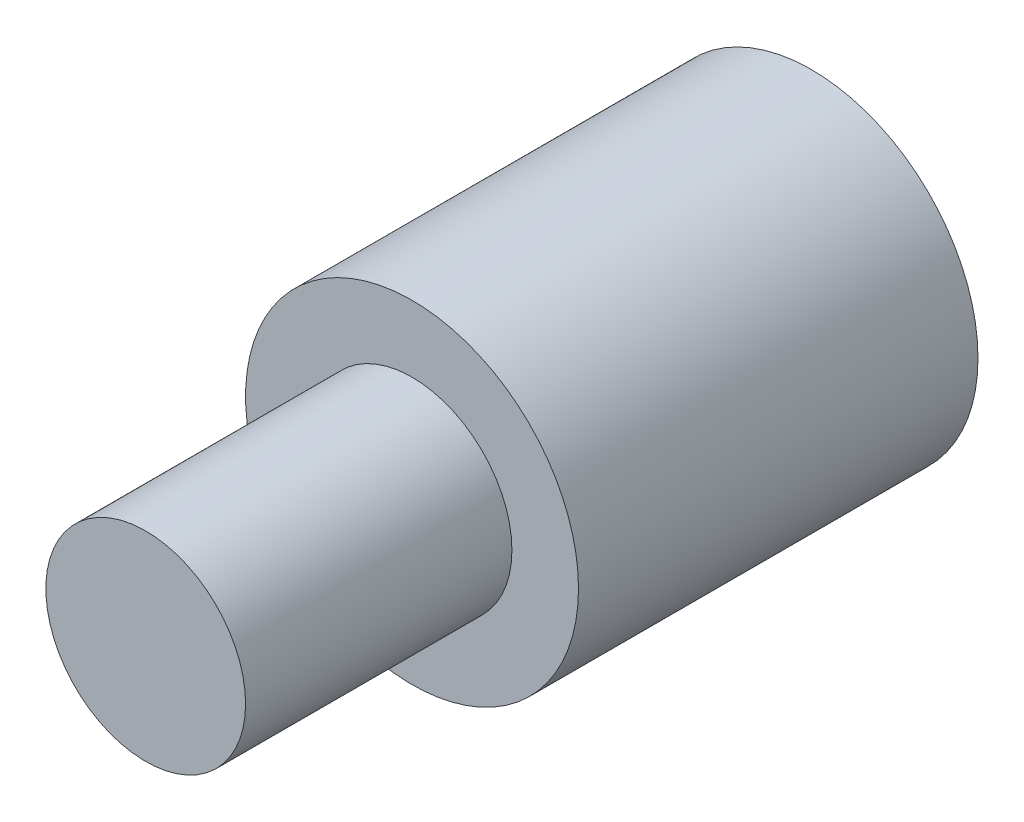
ISO-10303-21;
HEADER;
FILE_DESCRIPTION(('STEP AP214'),'2;1');
FILE_NAME('part.step','',(''),(''),'','','');
FILE_SCHEMA(('AUTOMOTIVE_DESIGN { 1 0 10303 214 1 1 1 1 }'));
ENDSEC;
DATA;
#1=APPLICATION_CONTEXT('core data for automotive mechanical design processes');
#2=APPLICATION_PROTOCOL_DEFINITION('international standard','automotive_design',2000,#1);
#3=PRODUCT_CONTEXT('',#1,'mechanical');
#4=PRODUCT('Part','Part','',(#3));
#5=PRODUCT_RELATED_PRODUCT_CATEGORY('part','',(#4));
#6=PRODUCT_DEFINITION_FORMATION('','',#4);
#7=PRODUCT_DEFINITION_CONTEXT('part definition',#1,'design');
#8=PRODUCT_DEFINITION('design','',#6,#7);
#9=PRODUCT_DEFINITION_SHAPE('','',#8);
#10=(LENGTH_UNIT() NAMED_UNIT(*) SI_UNIT(.MILLI.,.METRE.));
#11=(NAMED_UNIT(*) PLANE_ANGLE_UNIT() SI_UNIT($,.RADIAN.));
#12=(NAMED_UNIT(*) SI_UNIT($,.STERADIAN.) SOLID_ANGLE_UNIT());
#13=UNCERTAINTY_MEASURE_WITH_UNIT(LENGTH_MEASURE(1.E-05),#10,'distance_accuracy_value','');
#14=(GEOMETRIC_REPRESENTATION_CONTEXT(3) GLOBAL_UNCERTAINTY_ASSIGNED_CONTEXT((#13)) GLOBAL_UNIT_ASSIGNED_CONTEXT((#10,
#11,#12)) REPRESENTATION_CONTEXT('',''));
#15=CARTESIAN_POINT('',(0.,0.,0.));
#16=DIRECTION('',(0.,0.,1.));
#17=DIRECTION('',(1.,0.,0.));
#18=AXIS2_PLACEMENT_3D('',#15,#16,#17);
#19=CARTESIAN_POINT('',(0.,0.,6.));
#20=DIRECTION('',(0.,0.,1.));
#21=DIRECTION('',(1.,0.,0.));
#22=AXIS2_PLACEMENT_3D('',#19,#20,#21);
#23=PLANE('',#22);
#24=CARTESIAN_POINT('',(0.,0.,6.));
#25=DIRECTION('',(0.,0.,1.));
#26=DIRECTION('',(1.,0.,0.));
#27=AXIS2_PLACEMENT_3D('',#24,#25,#26);
#28=CIRCLE('',#27,2.5);
#29=CARTESIAN_POINT('',(2.5,0.,6.));
#30=VERTEX_POINT('',#29);
#31=EDGE_CURVE('E11',#30,#30,#28,.T.);
#32=ORIENTED_EDGE('',*,*,#31,.T.);
#33=EDGE_LOOP('',(#32));
#34=FACE_BOUND('',#33,.T.);
#35=CARTESIAN_POINT('',(0.,0.,6.));
#36=DIRECTION('',(0.,0.,1.));
#37=DIRECTION('',(1.,0.,0.));
#38=AXIS2_PLACEMENT_3D('',#35,#36,#37);
#39=CIRCLE('',#38,1.5);
#40=CARTESIAN_POINT('',(1.5,0.,6.));
#41=VERTEX_POINT('',#40);
#42=EDGE_CURVE('E53',#41,#41,#39,.T.);
#43=ORIENTED_EDGE('',*,*,#42,.F.);
#44=EDGE_LOOP('',(#43));
#45=FACE_BOUND('',#44,.T.);
#46=ADVANCED_FACE('F31',(#34,#45),#23,.T.);
#47=CARTESIAN_POINT('',(0.,0.,6.));
#48=DIRECTION('',(0.,0.,-1.));
#49=DIRECTION('',(-1.,0.,0.));
#50=AXIS2_PLACEMENT_3D('',#47,#48,#49);
#51=CYLINDRICAL_SURFACE('',#50,2.5);
#52=ORIENTED_EDGE('',*,*,#31,.F.);
#53=EDGE_LOOP('',(#52));
#54=FACE_BOUND('',#53,.T.);
#55=CARTESIAN_POINT('',(0.,0.,0.));
#56=DIRECTION('',(0.,0.,1.));
#57=DIRECTION('',(1.,0.,0.));
#58=AXIS2_PLACEMENT_3D('',#55,#56,#57);
#59=CIRCLE('',#58,2.5);
#60=CARTESIAN_POINT('',(2.5,0.,0.));
#61=VERTEX_POINT('',#60);
#62=EDGE_CURVE('E38',#61,#61,#59,.T.);
#63=ORIENTED_EDGE('',*,*,#62,.T.);
#64=EDGE_LOOP('',(#63));
#65=FACE_BOUND('',#64,.T.);
#66=ADVANCED_FACE('F33',(#54,#65),#51,.T.);
#67=CARTESIAN_POINT('',(0.,0.,0.));
#68=DIRECTION('',(0.,0.,1.));
#69=DIRECTION('',(1.,0.,0.));
#70=AXIS2_PLACEMENT_3D('',#67,#68,#69);
#71=PLANE('',#70);
#72=CARTESIAN_POINT('',(0.,0.,0.));
#73=DIRECTION('',(0.,0.,-1.));
#74=DIRECTION('',(-1.,0.,0.));
#75=AXIS2_PLACEMENT_3D('',#72,#73,#74);
#76=CIRCLE('',#75,1.25);
#77=CARTESIAN_POINT('',(-1.25,0.,0.));
#78=VERTEX_POINT('',#77);
#79=EDGE_CURVE('E50',#78,#78,#76,.T.);
#80=ORIENTED_EDGE('',*,*,#79,.F.);
#81=EDGE_LOOP('',(#80));
#82=FACE_BOUND('',#81,.T.);
#83=ORIENTED_EDGE('',*,*,#62,.F.);
#84=EDGE_LOOP('',(#83));
#85=FACE_BOUND('',#84,.T.);
#86=ADVANCED_FACE('F64',(#82,#85),#71,.F.);
#87=CARTESIAN_POINT('',(0.,0.,10.));
#88=DIRECTION('',(0.,0.,-1.));
#89=DIRECTION('',(-1.,0.,0.));
#90=AXIS2_PLACEMENT_3D('',#87,#88,#89);
#91=CYLINDRICAL_SURFACE('',#90,1.5);
#92=CARTESIAN_POINT('',(0.,0.,10.));
#93=DIRECTION('',(0.,0.,1.));
#94=DIRECTION('',(1.,0.,0.));
#95=AXIS2_PLACEMENT_3D('',#92,#93,#94);
#96=CIRCLE('',#95,1.5);
#97=CARTESIAN_POINT('',(1.5,0.,10.));
#98=VERTEX_POINT('',#97);
#99=EDGE_CURVE('E58',#98,#98,#96,.T.);
#100=ORIENTED_EDGE('',*,*,#99,.F.);
#101=EDGE_LOOP('',(#100));
#102=FACE_BOUND('',#101,.T.);
#103=ORIENTED_EDGE('',*,*,#42,.T.);
#104=EDGE_LOOP('',(#103));
#105=FACE_BOUND('',#104,.T.);
#106=ADVANCED_FACE('F66',(#102,#105),#91,.T.);
#107=CARTESIAN_POINT('',(0.,0.,10.));
#108=DIRECTION('',(0.,0.,1.));
#109=DIRECTION('',(1.,0.,0.));
#110=AXIS2_PLACEMENT_3D('',#107,#108,#109);
#111=PLANE('',#110);
#112=ORIENTED_EDGE('',*,*,#99,.T.);
#113=EDGE_LOOP('',(#112));
#114=FACE_BOUND('',#113,.T.);
#115=ADVANCED_FACE('F74',(#114),#111,.T.);
#116=CARTESIAN_POINT('',(0.,0.,0.));
#117=DIRECTION('',(0.,0.,-1.));
#118=DIRECTION('',(-1.,0.,0.));
#119=AXIS2_PLACEMENT_3D('',#116,#117,#118);
#120=CYLINDRICAL_SURFACE('',#119,1.25);
#121=CARTESIAN_POINT('',(0.,0.,7.5));
#122=DIRECTION('',(0.,0.,-1.));
#123=DIRECTION('',(-1.,0.,0.));
#124=AXIS2_PLACEMENT_3D('',#121,#122,#123);
#125=CIRCLE('',#124,1.25);
#126=CARTESIAN_POINT('',(-1.25,0.,7.5));
#127=VERTEX_POINT('',#126);
#128=EDGE_CURVE('E48',#127,#127,#125,.T.);
#129=ORIENTED_EDGE('',*,*,#128,.F.);
#130=EDGE_LOOP('',(#129));
#131=FACE_BOUND('',#130,.T.);
#132=ORIENTED_EDGE('',*,*,#79,.T.);
#133=EDGE_LOOP('',(#132));
#134=FACE_BOUND('',#133,.T.);
#135=ADVANCED_FACE('F44',(#131,#134),#120,.F.);
#136=CARTESIAN_POINT('',(0.,0.,7.5));
#137=DIRECTION('',(0.,0.,-1.));
#138=DIRECTION('',(-1.,0.,0.));
#139=AXIS2_PLACEMENT_3D('',#136,#137,#138);
#140=CONICAL_SURFACE('',#139,1.25,1.02974425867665);
#141=CARTESIAN_POINT('',(0.,0.,8.25107577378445));
#142=VERTEX_POINT('',#141);
#143=VERTEX_LOOP('',#142);
#144=FACE_BOUND('',#143,.T.);
#145=ORIENTED_EDGE('',*,*,#128,.T.);
#146=EDGE_LOOP('',(#145));
#147=FACE_BOUND('',#146,.T.);
#148=ADVANCED_FACE('F41',(#144,#147),#140,.F.);
#149=CLOSED_SHELL('',(#46,#66,#86,#106,#115,#135,#148));
#150=MANIFOLD_SOLID_BREP('B2',#149);
#151=ADVANCED_BREP_SHAPE_REPRESENTATION('',(#18,#150),#14);
#152=SHAPE_DEFINITION_REPRESENTATION(#9,#151);
ENDSEC;
END-ISO-10303-21;
